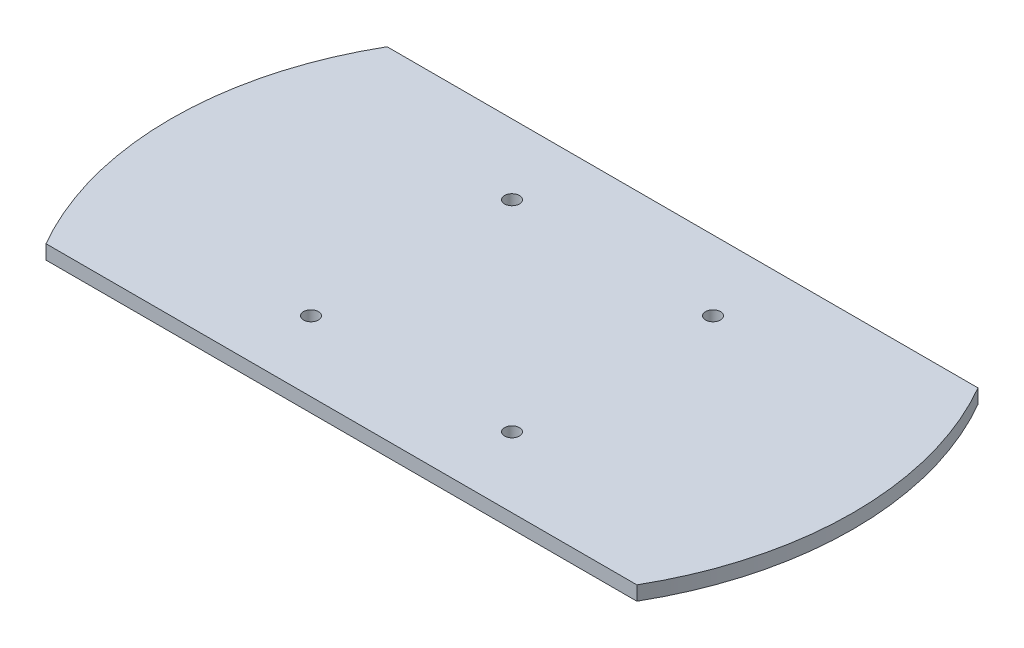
from build123d import *

# Parameters (mm, degrees)
EXTRUDE1_DEPTH = 6.35
SKETCH2_R      = 3.302
EXTRUDE2_DEPTH = 6.35


with BuildPart() as part:
    # Sketch1 → Extrude1 (new body)
    with BuildSketch(Plane(origin=(0, 0, 0), x_dir=(1, 0, 0), z_dir=(0, 1, 0))):
        with BuildLine():
            Line((-131.982271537, -76.2), (131.982271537, -76.2))
            ThreePointArc((131.982271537, -76.2), (152.4, 0), (131.982271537, 76.2))
            Line((131.982271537, 76.2), (-131.982271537, 76.2))
            ThreePointArc((-131.982271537, 76.2), (-152.4, 0), (-131.982271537, -76.2))
        make_face()
    extrude(amount=EXTRUDE1_DEPTH)

    # Sketch2 → Extrude2 (cut)
    with BuildSketch(Plane(origin=(0, 6.35, 0), x_dir=(1, 0, 0), z_dir=(0, 1, 0))):
        with Locations((-44.901280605, 44.901280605)):
            Circle(SKETCH2_R)
        with Locations((44.901280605, 44.901280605)):
            Circle(SKETCH2_R)
        with Locations((44.901280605, -44.901280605)):
            Circle(SKETCH2_R)
        with Locations((-44.901280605, -44.901280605)):
            Circle(SKETCH2_R)
    extrude(amount=-EXTRUDE2_DEPTH, mode=Mode.SUBTRACT)


solid = part.part
